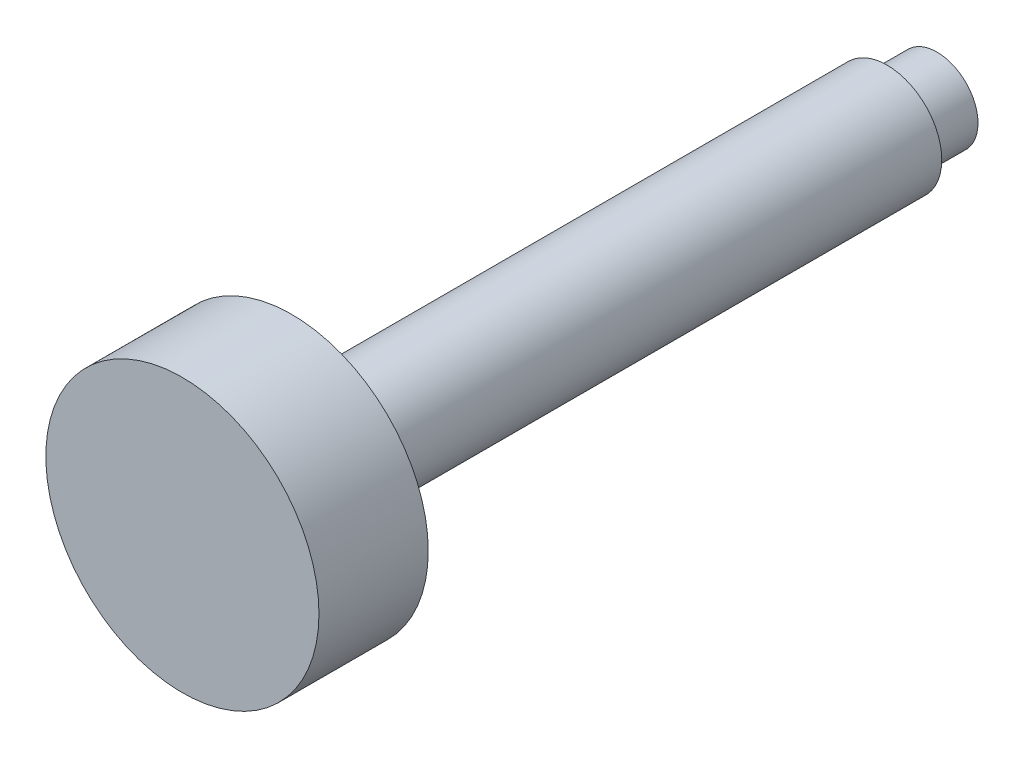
ISO-10303-21;
HEADER;
FILE_DESCRIPTION(('STEP AP214'),'2;1');
FILE_NAME('part.step','',(''),(''),'','','');
FILE_SCHEMA(('AUTOMOTIVE_DESIGN { 1 0 10303 214 1 1 1 1 }'));
ENDSEC;
DATA;
#1=APPLICATION_CONTEXT('core data for automotive mechanical design processes');
#2=APPLICATION_PROTOCOL_DEFINITION('international standard','automotive_design',2000,#1);
#3=PRODUCT_CONTEXT('',#1,'mechanical');
#4=PRODUCT('Part','Part','',(#3));
#5=PRODUCT_RELATED_PRODUCT_CATEGORY('part','',(#4));
#6=PRODUCT_DEFINITION_FORMATION('','',#4);
#7=PRODUCT_DEFINITION_CONTEXT('part definition',#1,'design');
#8=PRODUCT_DEFINITION('design','',#6,#7);
#9=PRODUCT_DEFINITION_SHAPE('','',#8);
#10=(LENGTH_UNIT() NAMED_UNIT(*) SI_UNIT(.MILLI.,.METRE.));
#11=(NAMED_UNIT(*) PLANE_ANGLE_UNIT() SI_UNIT($,.RADIAN.));
#12=(NAMED_UNIT(*) SI_UNIT($,.STERADIAN.) SOLID_ANGLE_UNIT());
#13=UNCERTAINTY_MEASURE_WITH_UNIT(LENGTH_MEASURE(1.E-05),#10,'distance_accuracy_value','');
#14=(GEOMETRIC_REPRESENTATION_CONTEXT(3) GLOBAL_UNCERTAINTY_ASSIGNED_CONTEXT((#13)) GLOBAL_UNIT_ASSIGNED_CONTEXT((#10,
#11,#12)) REPRESENTATION_CONTEXT('',''));
#15=CARTESIAN_POINT('',(0.,0.,0.));
#16=DIRECTION('',(0.,0.,1.));
#17=DIRECTION('',(1.,0.,0.));
#18=AXIS2_PLACEMENT_3D('',#15,#16,#17);
#19=CARTESIAN_POINT('',(0.,0.,8.));
#20=DIRECTION('',(0.,0.,1.));
#21=DIRECTION('',(1.,0.,0.));
#22=AXIS2_PLACEMENT_3D('',#19,#20,#21);
#23=SPHERICAL_SURFACE('',#22,8.);
#24=CARTESIAN_POINT('',(0.,0.,0.933352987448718));
#25=DIRECTION('',(0.,0.,1.));
#26=DIRECTION('',(1.,0.,0.));
#27=AXIS2_PLACEMENT_3D('',#24,#25,#26);
#28=CIRCLE('',#27,3.75);
#29=CARTESIAN_POINT('',(3.75,0.,0.933352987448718));
#30=VERTEX_POINT('',#29);
#31=EDGE_CURVE('E8',#30,#30,#28,.T.);
#32=ORIENTED_EDGE('',*,*,#31,.F.);
#33=EDGE_LOOP('',(#32));
#34=FACE_BOUND('',#33,.T.);
#35=ADVANCED_FACE('F12',(#34),#23,.T.);
#36=CARTESIAN_POINT('',(0.,0.,40.017563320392));
#37=DIRECTION('',(0.,0.,1.));
#38=DIRECTION('',(1.,0.,0.));
#39=AXIS2_PLACEMENT_3D('',#36,#37,#38);
#40=CYLINDRICAL_SURFACE('',#39,3.75);
#41=CARTESIAN_POINT('',(0.,0.,5.5));
#42=DIRECTION('',(0.,0.,1.));
#43=DIRECTION('',(1.,0.,0.));
#44=AXIS2_PLACEMENT_3D('',#41,#42,#43);
#45=CIRCLE('',#44,3.75);
#46=CARTESIAN_POINT('',(3.75,0.,5.5));
#47=VERTEX_POINT('',#46);
#48=EDGE_CURVE('E18',#47,#47,#45,.T.);
#49=ORIENTED_EDGE('',*,*,#48,.F.);
#50=EDGE_LOOP('',(#49));
#51=FACE_BOUND('',#50,.T.);
#52=ORIENTED_EDGE('',*,*,#31,.T.);
#53=EDGE_LOOP('',(#52));
#54=FACE_BOUND('',#53,.T.);
#55=ADVANCED_FACE('F60',(#51,#54),#40,.T.);
#56=CARTESIAN_POINT('',(-3.75,0.,5.5));
#57=DIRECTION('',(0.,0.,1.));
#58=DIRECTION('',(1.,0.,0.));
#59=AXIS2_PLACEMENT_3D('',#56,#57,#58);
#60=PLANE('',#59);
#61=CARTESIAN_POINT('',(0.,0.,5.5));
#62=DIRECTION('',(0.,0.,1.));
#63=DIRECTION('',(1.,0.,0.));
#64=AXIS2_PLACEMENT_3D('',#61,#62,#63);
#65=CIRCLE('',#64,5.);
#66=CARTESIAN_POINT('',(5.,0.,5.5));
#67=VERTEX_POINT('',#66);
#68=EDGE_CURVE('E22',#67,#67,#65,.T.);
#69=ORIENTED_EDGE('',*,*,#68,.F.);
#70=EDGE_LOOP('',(#69));
#71=FACE_BOUND('',#70,.T.);
#72=ORIENTED_EDGE('',*,*,#48,.T.);
#73=EDGE_LOOP('',(#72));
#74=FACE_BOUND('',#73,.T.);
#75=ADVANCED_FACE('F55',(#71,#74),#60,.F.);
#76=CARTESIAN_POINT('',(0.,0.,40.017563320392));
#77=DIRECTION('',(0.,0.,1.));
#78=DIRECTION('',(1.,0.,0.));
#79=AXIS2_PLACEMENT_3D('',#76,#77,#78);
#80=CYLINDRICAL_SURFACE('',#79,5.);
#81=CARTESIAN_POINT('',(0.,0.,60.));
#82=DIRECTION('',(0.,0.,1.));
#83=DIRECTION('',(1.,0.,0.));
#84=AXIS2_PLACEMENT_3D('',#81,#82,#83);
#85=CIRCLE('',#84,5.);
#86=CARTESIAN_POINT('',(5.,0.,60.));
#87=VERTEX_POINT('',#86);
#88=EDGE_CURVE('E26',#87,#87,#85,.T.);
#89=ORIENTED_EDGE('',*,*,#88,.F.);
#90=EDGE_LOOP('',(#89));
#91=FACE_BOUND('',#90,.T.);
#92=ORIENTED_EDGE('',*,*,#68,.T.);
#93=EDGE_LOOP('',(#92));
#94=FACE_BOUND('',#93,.T.);
#95=ADVANCED_FACE('F49',(#91,#94),#80,.T.);
#96=CARTESIAN_POINT('',(-5.,0.,60.));
#97=DIRECTION('',(0.,0.,1.));
#98=DIRECTION('',(1.,0.,0.));
#99=AXIS2_PLACEMENT_3D('',#96,#97,#98);
#100=PLANE('',#99);
#101=CARTESIAN_POINT('',(0.,0.,60.));
#102=DIRECTION('',(0.,0.,1.));
#103=DIRECTION('',(1.,0.,0.));
#104=AXIS2_PLACEMENT_3D('',#101,#102,#103);
#105=CIRCLE('',#104,12.5);
#106=CARTESIAN_POINT('',(12.5,0.,60.));
#107=VERTEX_POINT('',#106);
#108=EDGE_CURVE('E31',#107,#107,#105,.T.);
#109=ORIENTED_EDGE('',*,*,#108,.F.);
#110=EDGE_LOOP('',(#109));
#111=FACE_BOUND('',#110,.T.);
#112=ORIENTED_EDGE('',*,*,#88,.T.);
#113=EDGE_LOOP('',(#112));
#114=FACE_BOUND('',#113,.T.);
#115=ADVANCED_FACE('F43',(#111,#114),#100,.F.);
#116=CARTESIAN_POINT('',(0.,0.,40.017563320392));
#117=DIRECTION('',(0.,0.,1.));
#118=DIRECTION('',(1.,0.,0.));
#119=AXIS2_PLACEMENT_3D('',#116,#117,#118);
#120=CYLINDRICAL_SURFACE('',#119,12.5);
#121=CARTESIAN_POINT('',(0.,0.,70.));
#122=DIRECTION('',(0.,0.,1.));
#123=DIRECTION('',(1.,0.,0.));
#124=AXIS2_PLACEMENT_3D('',#121,#122,#123);
#125=CIRCLE('',#124,12.5);
#126=CARTESIAN_POINT('',(12.5,0.,70.));
#127=VERTEX_POINT('',#126);
#128=EDGE_CURVE('E34',#127,#127,#125,.T.);
#129=ORIENTED_EDGE('',*,*,#128,.F.);
#130=EDGE_LOOP('',(#129));
#131=FACE_BOUND('',#130,.T.);
#132=ORIENTED_EDGE('',*,*,#108,.T.);
#133=EDGE_LOOP('',(#132));
#134=FACE_BOUND('',#133,.T.);
#135=ADVANCED_FACE('F40',(#131,#134),#120,.T.);
#136=CARTESIAN_POINT('',(-12.5,0.,70.));
#137=DIRECTION('',(0.,0.,-1.));
#138=DIRECTION('',(-1.,0.,0.));
#139=AXIS2_PLACEMENT_3D('',#136,#137,#138);
#140=PLANE('',#139);
#141=ORIENTED_EDGE('',*,*,#128,.T.);
#142=EDGE_LOOP('',(#141));
#143=FACE_BOUND('',#142,.T.);
#144=ADVANCED_FACE('F38',(#143),#140,.F.);
#145=CLOSED_SHELL('',(#35,#55,#75,#95,#115,#135,#144));
#146=MANIFOLD_SOLID_BREP('B1',#145);
#147=ADVANCED_BREP_SHAPE_REPRESENTATION('',(#18,#146),#14);
#148=SHAPE_DEFINITION_REPRESENTATION(#9,#147);
ENDSEC;
END-ISO-10303-21;
